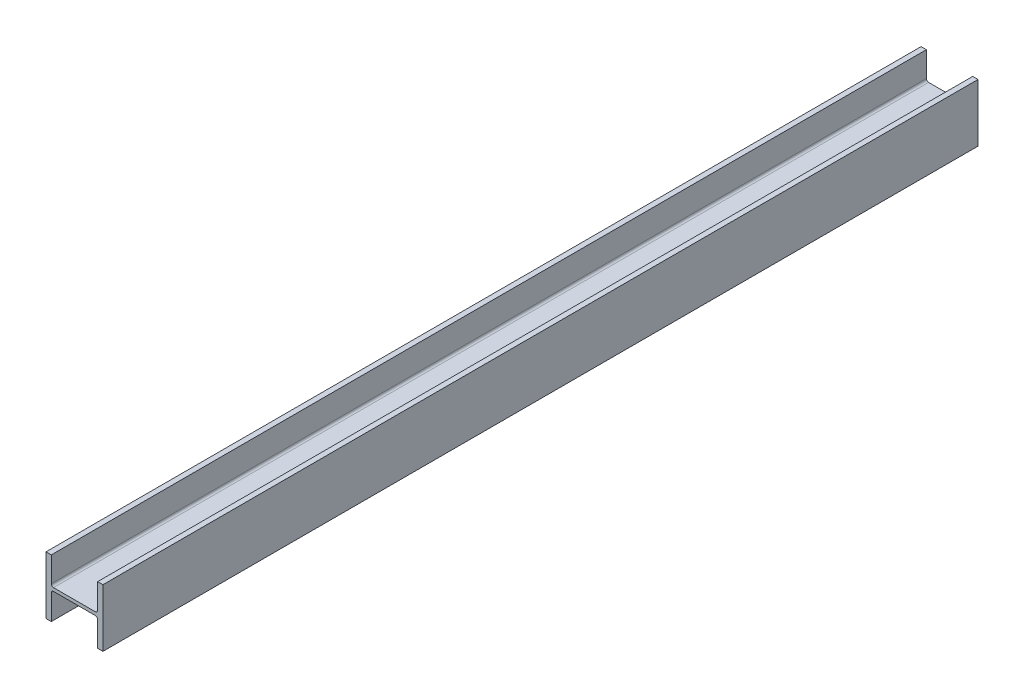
ISO-10303-21;
HEADER;
FILE_DESCRIPTION(('STEP AP214'),'2;1');
FILE_NAME('part.step','',(''),(''),'','','');
FILE_SCHEMA(('AUTOMOTIVE_DESIGN { 1 0 10303 214 1 1 1 1 }'));
ENDSEC;
DATA;
#1=APPLICATION_CONTEXT('core data for automotive mechanical design processes');
#2=APPLICATION_PROTOCOL_DEFINITION('international standard','automotive_design',2000,#1);
#3=PRODUCT_CONTEXT('',#1,'mechanical');
#4=PRODUCT('Part','Part','',(#3));
#5=PRODUCT_RELATED_PRODUCT_CATEGORY('part','',(#4));
#6=PRODUCT_DEFINITION_FORMATION('','',#4);
#7=PRODUCT_DEFINITION_CONTEXT('part definition',#1,'design');
#8=PRODUCT_DEFINITION('design','',#6,#7);
#9=PRODUCT_DEFINITION_SHAPE('','',#8);
#10=(LENGTH_UNIT() NAMED_UNIT(*) SI_UNIT(.MILLI.,.METRE.));
#11=(NAMED_UNIT(*) PLANE_ANGLE_UNIT() SI_UNIT($,.RADIAN.));
#12=(NAMED_UNIT(*) SI_UNIT($,.STERADIAN.) SOLID_ANGLE_UNIT());
#13=UNCERTAINTY_MEASURE_WITH_UNIT(LENGTH_MEASURE(1.E-05),#10,'distance_accuracy_value','');
#14=(GEOMETRIC_REPRESENTATION_CONTEXT(3) GLOBAL_UNCERTAINTY_ASSIGNED_CONTEXT((#13)) GLOBAL_UNIT_ASSIGNED_CONTEXT((#10,
#11,#12)) REPRESENTATION_CONTEXT('',''));
#15=CARTESIAN_POINT('',(0.,0.,0.));
#16=DIRECTION('',(0.,0.,1.));
#17=DIRECTION('',(1.,0.,0.));
#18=AXIS2_PLACEMENT_3D('',#15,#16,#17);
#19=CARTESIAN_POINT('',(196.596,199.517,3022.6));
#20=DIRECTION('',(-1.,0.,0.));
#21=DIRECTION('',(0.,0.,1.));
#22=AXIS2_PLACEMENT_3D('',#19,#20,#21);
#23=PLANE('',#22);
#24=DIRECTION('',(0.,1.,0.));
#25=VECTOR('',#24,1.);
#26=CARTESIAN_POINT('',(196.596,199.517,-3022.6));
#27=LINE('',#26,#25);
#28=CARTESIAN_POINT('',(196.596,-199.517,-3022.6));
#29=VERTEX_POINT('',#28);
#30=CARTESIAN_POINT('',(196.596,199.517,-3022.6));
#31=VERTEX_POINT('',#30);
#32=EDGE_CURVE('E194',#29,#31,#27,.T.);
#33=ORIENTED_EDGE('',*,*,#32,.T.);
#34=DIRECTION('',(0.,0.,-1.));
#35=VECTOR('',#34,1.);
#36=CARTESIAN_POINT('',(196.596,199.517,3022.6));
#37=LINE('',#36,#35);
#38=CARTESIAN_POINT('',(196.596,199.517,3022.6));
#39=VERTEX_POINT('',#38);
#40=EDGE_CURVE('E11',#39,#31,#37,.T.);
#41=ORIENTED_EDGE('',*,*,#40,.F.);
#42=DIRECTION('',(0.,1.,0.));
#43=VECTOR('',#42,1.);
#44=CARTESIAN_POINT('',(196.596,199.517,3022.6));
#45=LINE('',#44,#43);
#46=CARTESIAN_POINT('',(196.596,-199.517,3022.6));
#47=VERTEX_POINT('',#46);
#48=EDGE_CURVE('E238',#47,#39,#45,.T.);
#49=ORIENTED_EDGE('',*,*,#48,.F.);
#50=DIRECTION('',(0.,0.,-1.));
#51=VECTOR('',#50,1.);
#52=CARTESIAN_POINT('',(196.596,-199.517,3022.6));
#53=LINE('',#52,#51);
#54=EDGE_CURVE('E187',#47,#29,#53,.T.);
#55=ORIENTED_EDGE('',*,*,#54,.T.);
#56=EDGE_LOOP('',(#33,#41,#49,#55));
#57=FACE_BOUND('',#56,.T.);
#58=ADVANCED_FACE('F44',(#57),#23,.F.);
#59=CARTESIAN_POINT('',(160.02,199.517,3022.6));
#60=DIRECTION('',(0.,-1.,0.));
#61=DIRECTION('',(0.,0.,-1.));
#62=AXIS2_PLACEMENT_3D('',#59,#60,#61);
#63=PLANE('',#62);
#64=DIRECTION('',(-1.,0.,0.));
#65=VECTOR('',#64,1.);
#66=CARTESIAN_POINT('',(160.02,199.517,-3022.6));
#67=LINE('',#66,#65);
#68=CARTESIAN_POINT('',(160.02,199.517,-3022.6));
#69=VERTEX_POINT('',#68);
#70=EDGE_CURVE('E196',#31,#69,#67,.T.);
#71=ORIENTED_EDGE('',*,*,#70,.T.);
#72=DIRECTION('',(0.,0.,-1.));
#73=VECTOR('',#72,1.);
#74=CARTESIAN_POINT('',(160.02,199.517,3022.6));
#75=LINE('',#74,#73);
#76=CARTESIAN_POINT('',(160.02,199.517,3022.6));
#77=VERTEX_POINT('',#76);
#78=EDGE_CURVE('E53',#77,#69,#75,.T.);
#79=ORIENTED_EDGE('',*,*,#78,.F.);
#80=DIRECTION('',(-1.,0.,0.));
#81=VECTOR('',#80,1.);
#82=CARTESIAN_POINT('',(160.02,199.517,3022.6));
#83=LINE('',#82,#81);
#84=EDGE_CURVE('E129',#39,#77,#83,.T.);
#85=ORIENTED_EDGE('',*,*,#84,.F.);
#86=ORIENTED_EDGE('',*,*,#40,.T.);
#87=EDGE_LOOP('',(#71,#79,#85,#86));
#88=FACE_BOUND('',#87,.T.);
#89=ADVANCED_FACE('F362',(#88),#63,.F.);
#90=CARTESIAN_POINT('',(160.02,26.5430000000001,3022.6));
#91=DIRECTION('',(1.,0.,0.));
#92=DIRECTION('',(0.,0.,-1.));
#93=AXIS2_PLACEMENT_3D('',#90,#91,#92);
#94=PLANE('',#93);
#95=DIRECTION('',(0.,-1.,0.));
#96=VECTOR('',#95,1.);
#97=CARTESIAN_POINT('',(160.02,26.5430000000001,-3022.6));
#98=LINE('',#97,#96);
#99=CARTESIAN_POINT('',(160.02,26.5430000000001,-3022.6));
#100=VERTEX_POINT('',#99);
#101=EDGE_CURVE('E203',#69,#100,#98,.T.);
#102=ORIENTED_EDGE('',*,*,#101,.T.);
#103=DIRECTION('',(0.,0.,-1.));
#104=VECTOR('',#103,1.);
#105=CARTESIAN_POINT('',(160.02,26.5430000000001,3022.6));
#106=LINE('',#105,#104);
#107=CARTESIAN_POINT('',(160.02,26.5430000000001,3022.6));
#108=VERTEX_POINT('',#107);
#109=EDGE_CURVE('E281',#108,#100,#106,.T.);
#110=ORIENTED_EDGE('',*,*,#109,.F.);
#111=DIRECTION('',(0.,-1.,0.));
#112=VECTOR('',#111,1.);
#113=CARTESIAN_POINT('',(160.02,26.5430000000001,3022.6));
#114=LINE('',#113,#112);
#115=EDGE_CURVE('E291',#77,#108,#114,.T.);
#116=ORIENTED_EDGE('',*,*,#115,.F.);
#117=ORIENTED_EDGE('',*,*,#78,.T.);
#118=EDGE_LOOP('',(#102,#110,#116,#117));
#119=FACE_BOUND('',#118,.T.);
#120=ADVANCED_FACE('F292',(#119),#94,.F.);
#121=CARTESIAN_POINT('',(144.78,26.5430000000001,3022.6));
#122=DIRECTION('',(0.,0.,-1.));
#123=DIRECTION('',(-1.,0.,0.));
#124=AXIS2_PLACEMENT_3D('',#121,#122,#123);
#125=CYLINDRICAL_SURFACE('',#124,15.24);
#126=CARTESIAN_POINT('',(144.78,26.5430000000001,-3022.6));
#127=DIRECTION('',(0.,0.,-1.));
#128=DIRECTION('',(1.,0.,0.));
#129=AXIS2_PLACEMENT_3D('',#126,#127,#128);
#130=CIRCLE('',#129,15.24);
#131=CARTESIAN_POINT('',(144.78,11.3030000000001,-3022.6));
#132=VERTEX_POINT('',#131);
#133=EDGE_CURVE('E204',#100,#132,#130,.T.);
#134=ORIENTED_EDGE('',*,*,#133,.T.);
#135=DIRECTION('',(0.,0.,-1.));
#136=VECTOR('',#135,1.);
#137=CARTESIAN_POINT('',(144.78,11.3030000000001,3022.6));
#138=LINE('',#137,#136);
#139=CARTESIAN_POINT('',(144.78,11.3030000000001,3022.6));
#140=VERTEX_POINT('',#139);
#141=EDGE_CURVE('E276',#140,#132,#138,.T.);
#142=ORIENTED_EDGE('',*,*,#141,.F.);
#143=CARTESIAN_POINT('',(144.78,26.5430000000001,3022.6));
#144=DIRECTION('',(0.,0.,-1.));
#145=DIRECTION('',(1.,0.,0.));
#146=AXIS2_PLACEMENT_3D('',#143,#144,#145);
#147=CIRCLE('',#146,15.24);
#148=EDGE_CURVE('E315',#108,#140,#147,.T.);
#149=ORIENTED_EDGE('',*,*,#148,.F.);
#150=ORIENTED_EDGE('',*,*,#109,.T.);
#151=EDGE_LOOP('',(#134,#142,#149,#150));
#152=FACE_BOUND('',#151,.T.);
#153=ADVANCED_FACE('F305',(#152),#125,.F.);
#154=CARTESIAN_POINT('',(-144.78,11.3030000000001,3022.6));
#155=DIRECTION('',(0.,-1.,0.));
#156=DIRECTION('',(1.,0.,0.));
#157=AXIS2_PLACEMENT_3D('',#154,#155,#156);
#158=PLANE('',#157);
#159=DIRECTION('',(-1.,0.,0.));
#160=VECTOR('',#159,1.);
#161=CARTESIAN_POINT('',(-144.78,11.3030000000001,-3022.6));
#162=LINE('',#161,#160);
#163=CARTESIAN_POINT('',(-144.78,11.3030000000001,-3022.6));
#164=VERTEX_POINT('',#163);
#165=EDGE_CURVE('E210',#132,#164,#162,.T.);
#166=ORIENTED_EDGE('',*,*,#165,.T.);
#167=DIRECTION('',(0.,0.,-1.));
#168=VECTOR('',#167,1.);
#169=CARTESIAN_POINT('',(-144.78,11.3030000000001,3022.6));
#170=LINE('',#169,#168);
#171=CARTESIAN_POINT('',(-144.78,11.3030000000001,3022.6));
#172=VERTEX_POINT('',#171);
#173=EDGE_CURVE('E274',#172,#164,#170,.T.);
#174=ORIENTED_EDGE('',*,*,#173,.F.);
#175=DIRECTION('',(-1.,0.,0.));
#176=VECTOR('',#175,1.);
#177=CARTESIAN_POINT('',(-144.78,11.3030000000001,3022.6));
#178=LINE('',#177,#176);
#179=EDGE_CURVE('E306',#140,#172,#178,.T.);
#180=ORIENTED_EDGE('',*,*,#179,.F.);
#181=ORIENTED_EDGE('',*,*,#141,.T.);
#182=EDGE_LOOP('',(#166,#174,#180,#181));
#183=FACE_BOUND('',#182,.T.);
#184=ADVANCED_FACE('F308',(#183),#158,.F.);
#185=CARTESIAN_POINT('',(-144.78,26.5430000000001,3022.6));
#186=DIRECTION('',(0.,0.,-1.));
#187=DIRECTION('',(-1.,0.,0.));
#188=AXIS2_PLACEMENT_3D('',#185,#186,#187);
#189=CYLINDRICAL_SURFACE('',#188,15.24);
#190=CARTESIAN_POINT('',(-144.78,26.5430000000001,-3022.6));
#191=DIRECTION('',(0.,0.,-1.));
#192=DIRECTION('',(1.,0.,0.));
#193=AXIS2_PLACEMENT_3D('',#190,#191,#192);
#194=CIRCLE('',#193,15.24);
#195=CARTESIAN_POINT('',(-160.02,26.5430000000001,-3022.6));
#196=VERTEX_POINT('',#195);
#197=EDGE_CURVE('E209',#164,#196,#194,.T.);
#198=ORIENTED_EDGE('',*,*,#197,.T.);
#199=DIRECTION('',(0.,0.,-1.));
#200=VECTOR('',#199,1.);
#201=CARTESIAN_POINT('',(-160.02,26.5430000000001,3022.6));
#202=LINE('',#201,#200);
#203=CARTESIAN_POINT('',(-160.02,26.5430000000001,3022.6));
#204=VERTEX_POINT('',#203);
#205=EDGE_CURVE('E271',#204,#196,#202,.T.);
#206=ORIENTED_EDGE('',*,*,#205,.F.);
#207=CARTESIAN_POINT('',(-144.78,26.5430000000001,3022.6));
#208=DIRECTION('',(0.,0.,-1.));
#209=DIRECTION('',(1.,0.,0.));
#210=AXIS2_PLACEMENT_3D('',#207,#208,#209);
#211=CIRCLE('',#210,15.24);
#212=EDGE_CURVE('E313',#172,#204,#211,.T.);
#213=ORIENTED_EDGE('',*,*,#212,.F.);
#214=ORIENTED_EDGE('',*,*,#173,.T.);
#215=EDGE_LOOP('',(#198,#206,#213,#214));
#216=FACE_BOUND('',#215,.T.);
#217=ADVANCED_FACE('F374',(#216),#189,.F.);
#218=CARTESIAN_POINT('',(-160.02,199.517,3022.6));
#219=DIRECTION('',(-1.,0.,0.));
#220=DIRECTION('',(0.,0.,1.));
#221=AXIS2_PLACEMENT_3D('',#218,#219,#220);
#222=PLANE('',#221);
#223=DIRECTION('',(0.,1.,0.));
#224=VECTOR('',#223,1.);
#225=CARTESIAN_POINT('',(-160.02,199.517,-3022.6));
#226=LINE('',#225,#224);
#227=CARTESIAN_POINT('',(-160.02,199.517,-3022.6));
#228=VERTEX_POINT('',#227);
#229=EDGE_CURVE('E213',#196,#228,#226,.T.);
#230=ORIENTED_EDGE('',*,*,#229,.T.);
#231=DIRECTION('',(0.,0.,-1.));
#232=VECTOR('',#231,1.);
#233=CARTESIAN_POINT('',(-160.02,199.517,3022.6));
#234=LINE('',#233,#232);
#235=CARTESIAN_POINT('',(-160.02,199.517,3022.6));
#236=VERTEX_POINT('',#235);
#237=EDGE_CURVE('E270',#236,#228,#234,.T.);
#238=ORIENTED_EDGE('',*,*,#237,.F.);
#239=DIRECTION('',(0.,1.,0.));
#240=VECTOR('',#239,1.);
#241=CARTESIAN_POINT('',(-160.02,199.517,3022.6));
#242=LINE('',#241,#240);
#243=EDGE_CURVE('E316',#204,#236,#242,.T.);
#244=ORIENTED_EDGE('',*,*,#243,.F.);
#245=ORIENTED_EDGE('',*,*,#205,.T.);
#246=EDGE_LOOP('',(#230,#238,#244,#245));
#247=FACE_BOUND('',#246,.T.);
#248=ADVANCED_FACE('F378',(#247),#222,.F.);
#249=CARTESIAN_POINT('',(-196.596,199.517,3022.6));
#250=DIRECTION('',(0.,-1.,0.));
#251=DIRECTION('',(1.,0.,0.));
#252=AXIS2_PLACEMENT_3D('',#249,#250,#251);
#253=PLANE('',#252);
#254=DIRECTION('',(-1.,0.,0.));
#255=VECTOR('',#254,1.);
#256=CARTESIAN_POINT('',(-196.596,199.517,-3022.6));
#257=LINE('',#256,#255);
#258=CARTESIAN_POINT('',(-196.596,199.517,-3022.6));
#259=VERTEX_POINT('',#258);
#260=EDGE_CURVE('E216',#228,#259,#257,.T.);
#261=ORIENTED_EDGE('',*,*,#260,.T.);
#262=DIRECTION('',(0.,0.,-1.));
#263=VECTOR('',#262,1.);
#264=CARTESIAN_POINT('',(-196.596,199.517,3022.6));
#265=LINE('',#264,#263);
#266=CARTESIAN_POINT('',(-196.596,199.517,3022.6));
#267=VERTEX_POINT('',#266);
#268=EDGE_CURVE('E263',#267,#259,#265,.T.);
#269=ORIENTED_EDGE('',*,*,#268,.F.);
#270=DIRECTION('',(-1.,0.,0.));
#271=VECTOR('',#270,1.);
#272=CARTESIAN_POINT('',(-196.596,199.517,3022.6));
#273=LINE('',#272,#271);
#274=EDGE_CURVE('E323',#236,#267,#273,.T.);
#275=ORIENTED_EDGE('',*,*,#274,.F.);
#276=ORIENTED_EDGE('',*,*,#237,.T.);
#277=EDGE_LOOP('',(#261,#269,#275,#276));
#278=FACE_BOUND('',#277,.T.);
#279=ADVANCED_FACE('F385',(#278),#253,.F.);
#280=CARTESIAN_POINT('',(-196.596,-199.517,3022.6));
#281=DIRECTION('',(1.,0.,0.));
#282=DIRECTION('',(0.,0.,-1.));
#283=AXIS2_PLACEMENT_3D('',#280,#281,#282);
#284=PLANE('',#283);
#285=DIRECTION('',(0.,-1.,0.));
#286=VECTOR('',#285,1.);
#287=CARTESIAN_POINT('',(-196.596,-199.517,-3022.6));
#288=LINE('',#287,#286);
#289=CARTESIAN_POINT('',(-196.596,-199.517,-3022.6));
#290=VERTEX_POINT('',#289);
#291=EDGE_CURVE('E218',#259,#290,#288,.T.);
#292=ORIENTED_EDGE('',*,*,#291,.T.);
#293=DIRECTION('',(0.,0.,-1.));
#294=VECTOR('',#293,1.);
#295=CARTESIAN_POINT('',(-196.596,-199.517,3022.6));
#296=LINE('',#295,#294);
#297=CARTESIAN_POINT('',(-196.596,-199.517,3022.6));
#298=VERTEX_POINT('',#297);
#299=EDGE_CURVE('E259',#298,#290,#296,.T.);
#300=ORIENTED_EDGE('',*,*,#299,.F.);
#301=DIRECTION('',(0.,-1.,0.));
#302=VECTOR('',#301,1.);
#303=CARTESIAN_POINT('',(-196.596,-199.517,3022.6));
#304=LINE('',#303,#302);
#305=EDGE_CURVE('E326',#267,#298,#304,.T.);
#306=ORIENTED_EDGE('',*,*,#305,.F.);
#307=ORIENTED_EDGE('',*,*,#268,.T.);
#308=EDGE_LOOP('',(#292,#300,#306,#307));
#309=FACE_BOUND('',#308,.T.);
#310=ADVANCED_FACE('F387',(#309),#284,.F.);
#311=CARTESIAN_POINT('',(-160.02,-199.517,3022.6));
#312=DIRECTION('',(0.,1.,0.));
#313=DIRECTION('',(0.,0.,1.));
#314=AXIS2_PLACEMENT_3D('',#311,#312,#313);
#315=PLANE('',#314);
#316=DIRECTION('',(1.,0.,0.));
#317=VECTOR('',#316,1.);
#318=CARTESIAN_POINT('',(-160.02,-199.517,-3022.6));
#319=LINE('',#318,#317);
#320=CARTESIAN_POINT('',(-160.02,-199.517,-3022.6));
#321=VERTEX_POINT('',#320);
#322=EDGE_CURVE('E225',#290,#321,#319,.T.);
#323=ORIENTED_EDGE('',*,*,#322,.T.);
#324=DIRECTION('',(0.,0.,-1.));
#325=VECTOR('',#324,1.);
#326=CARTESIAN_POINT('',(-160.02,-199.517,3022.6));
#327=LINE('',#326,#325);
#328=CARTESIAN_POINT('',(-160.02,-199.517,3022.6));
#329=VERTEX_POINT('',#328);
#330=EDGE_CURVE('E254',#329,#321,#327,.T.);
#331=ORIENTED_EDGE('',*,*,#330,.F.);
#332=DIRECTION('',(1.,0.,0.));
#333=VECTOR('',#332,1.);
#334=CARTESIAN_POINT('',(-160.02,-199.517,3022.6));
#335=LINE('',#334,#333);
#336=EDGE_CURVE('E328',#298,#329,#335,.T.);
#337=ORIENTED_EDGE('',*,*,#336,.F.);
#338=ORIENTED_EDGE('',*,*,#299,.T.);
#339=EDGE_LOOP('',(#323,#331,#337,#338));
#340=FACE_BOUND('',#339,.T.);
#341=ADVANCED_FACE('F388',(#340),#315,.F.);
#342=CARTESIAN_POINT('',(-160.02,-26.5429999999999,3022.6));
#343=DIRECTION('',(-1.,0.,0.));
#344=DIRECTION('',(0.,0.,1.));
#345=AXIS2_PLACEMENT_3D('',#342,#343,#344);
#346=PLANE('',#345);
#347=DIRECTION('',(0.,1.,0.));
#348=VECTOR('',#347,1.);
#349=CARTESIAN_POINT('',(-160.02,-26.5429999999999,-3022.6));
#350=LINE('',#349,#348);
#351=CARTESIAN_POINT('',(-160.02,-26.5429999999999,-3022.6));
#352=VERTEX_POINT('',#351);
#353=EDGE_CURVE('E223',#321,#352,#350,.T.);
#354=ORIENTED_EDGE('',*,*,#353,.T.);
#355=DIRECTION('',(0.,0.,-1.));
#356=VECTOR('',#355,1.);
#357=CARTESIAN_POINT('',(-160.02,-26.5429999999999,3022.6));
#358=LINE('',#357,#356);
#359=CARTESIAN_POINT('',(-160.02,-26.5429999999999,3022.6));
#360=VERTEX_POINT('',#359);
#361=EDGE_CURVE('E253',#360,#352,#358,.T.);
#362=ORIENTED_EDGE('',*,*,#361,.F.);
#363=DIRECTION('',(0.,1.,0.));
#364=VECTOR('',#363,1.);
#365=CARTESIAN_POINT('',(-160.02,-26.5429999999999,3022.6));
#366=LINE('',#365,#364);
#367=EDGE_CURVE('E335',#329,#360,#366,.T.);
#368=ORIENTED_EDGE('',*,*,#367,.F.);
#369=ORIENTED_EDGE('',*,*,#330,.T.);
#370=EDGE_LOOP('',(#354,#362,#368,#369));
#371=FACE_BOUND('',#370,.T.);
#372=ADVANCED_FACE('F394',(#371),#346,.F.);
#373=CARTESIAN_POINT('',(-144.78,-26.5429999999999,3022.6));
#374=DIRECTION('',(0.,0.,-1.));
#375=DIRECTION('',(-1.,0.,0.));
#376=AXIS2_PLACEMENT_3D('',#373,#374,#375);
#377=CYLINDRICAL_SURFACE('',#376,15.24);
#378=CARTESIAN_POINT('',(-144.78,-26.5429999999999,-3022.6));
#379=DIRECTION('',(0.,0.,-1.));
#380=DIRECTION('',(1.,0.,0.));
#381=AXIS2_PLACEMENT_3D('',#378,#379,#380);
#382=CIRCLE('',#381,15.24);
#383=CARTESIAN_POINT('',(-144.78,-11.3029999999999,-3022.6));
#384=VERTEX_POINT('',#383);
#385=EDGE_CURVE('E226',#352,#384,#382,.T.);
#386=ORIENTED_EDGE('',*,*,#385,.T.);
#387=DIRECTION('',(0.,0.,-1.));
#388=VECTOR('',#387,1.);
#389=CARTESIAN_POINT('',(-144.78,-11.3029999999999,3022.6));
#390=LINE('',#389,#388);
#391=CARTESIAN_POINT('',(-144.78,-11.3029999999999,3022.6));
#392=VERTEX_POINT('',#391);
#393=EDGE_CURVE('E250',#392,#384,#390,.T.);
#394=ORIENTED_EDGE('',*,*,#393,.F.);
#395=CARTESIAN_POINT('',(-144.78,-26.5429999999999,3022.6));
#396=DIRECTION('',(0.,0.,-1.));
#397=DIRECTION('',(1.,0.,0.));
#398=AXIS2_PLACEMENT_3D('',#395,#396,#397);
#399=CIRCLE('',#398,15.24);
#400=EDGE_CURVE('E333',#360,#392,#399,.T.);
#401=ORIENTED_EDGE('',*,*,#400,.F.);
#402=ORIENTED_EDGE('',*,*,#361,.T.);
#403=EDGE_LOOP('',(#386,#394,#401,#402));
#404=FACE_BOUND('',#403,.T.);
#405=ADVANCED_FACE('F343',(#404),#377,.F.);
#406=CARTESIAN_POINT('',(144.78,-11.3029999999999,3022.6));
#407=DIRECTION('',(0.,1.,0.));
#408=DIRECTION('',(0.,0.,1.));
#409=AXIS2_PLACEMENT_3D('',#406,#407,#408);
#410=PLANE('',#409);
#411=DIRECTION('',(1.,0.,0.));
#412=VECTOR('',#411,1.);
#413=CARTESIAN_POINT('',(144.78,-11.3029999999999,-3022.6));
#414=LINE('',#413,#412);
#415=CARTESIAN_POINT('',(144.78,-11.3029999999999,-3022.6));
#416=VERTEX_POINT('',#415);
#417=EDGE_CURVE('E232',#384,#416,#414,.T.);
#418=ORIENTED_EDGE('',*,*,#417,.T.);
#419=DIRECTION('',(0.,0.,-1.));
#420=VECTOR('',#419,1.);
#421=CARTESIAN_POINT('',(144.78,-11.3029999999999,3022.6));
#422=LINE('',#421,#420);
#423=CARTESIAN_POINT('',(144.78,-11.3029999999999,3022.6));
#424=VERTEX_POINT('',#423);
#425=EDGE_CURVE('E181',#424,#416,#422,.T.);
#426=ORIENTED_EDGE('',*,*,#425,.F.);
#427=DIRECTION('',(1.,0.,0.));
#428=VECTOR('',#427,1.);
#429=CARTESIAN_POINT('',(144.78,-11.3029999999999,3022.6));
#430=LINE('',#429,#428);
#431=EDGE_CURVE('E175',#392,#424,#430,.T.);
#432=ORIENTED_EDGE('',*,*,#431,.F.);
#433=ORIENTED_EDGE('',*,*,#393,.T.);
#434=EDGE_LOOP('',(#418,#426,#432,#433));
#435=FACE_BOUND('',#434,.T.);
#436=ADVANCED_FACE('F350',(#435),#410,.F.);
#437=CARTESIAN_POINT('',(144.78,-26.5429999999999,3022.6));
#438=DIRECTION('',(0.,0.,-1.));
#439=DIRECTION('',(-1.,0.,0.));
#440=AXIS2_PLACEMENT_3D('',#437,#438,#439);
#441=CYLINDRICAL_SURFACE('',#440,15.24);
#442=CARTESIAN_POINT('',(144.78,-26.5429999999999,-3022.6));
#443=DIRECTION('',(0.,0.,-1.));
#444=DIRECTION('',(1.,0.,0.));
#445=AXIS2_PLACEMENT_3D('',#442,#443,#444);
#446=CIRCLE('',#445,15.24);
#447=CARTESIAN_POINT('',(160.02,-26.5429999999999,-3022.6));
#448=VERTEX_POINT('',#447);
#449=EDGE_CURVE('E182',#416,#448,#446,.T.);
#450=ORIENTED_EDGE('',*,*,#449,.T.);
#451=DIRECTION('',(0.,0.,-1.));
#452=VECTOR('',#451,1.);
#453=CARTESIAN_POINT('',(160.02,-26.5429999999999,3022.6));
#454=LINE('',#453,#452);
#455=CARTESIAN_POINT('',(160.02,-26.5429999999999,3022.6));
#456=VERTEX_POINT('',#455);
#457=EDGE_CURVE('E178',#456,#448,#454,.T.);
#458=ORIENTED_EDGE('',*,*,#457,.F.);
#459=CARTESIAN_POINT('',(144.78,-26.5429999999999,3022.6));
#460=DIRECTION('',(0.,0.,-1.));
#461=DIRECTION('',(1.,0.,0.));
#462=AXIS2_PLACEMENT_3D('',#459,#460,#461);
#463=CIRCLE('',#462,15.24);
#464=EDGE_CURVE('E167',#424,#456,#463,.T.);
#465=ORIENTED_EDGE('',*,*,#464,.F.);
#466=ORIENTED_EDGE('',*,*,#425,.T.);
#467=EDGE_LOOP('',(#450,#458,#465,#466));
#468=FACE_BOUND('',#467,.T.);
#469=ADVANCED_FACE('F179',(#468),#441,.F.);
#470=CARTESIAN_POINT('',(160.02,-199.517,3022.6));
#471=DIRECTION('',(1.,0.,0.));
#472=DIRECTION('',(0.,0.,-1.));
#473=AXIS2_PLACEMENT_3D('',#470,#471,#472);
#474=PLANE('',#473);
#475=DIRECTION('',(0.,-1.,0.));
#476=VECTOR('',#475,1.);
#477=CARTESIAN_POINT('',(160.02,-199.517,-3022.6));
#478=LINE('',#477,#476);
#479=CARTESIAN_POINT('',(160.02,-199.517,-3022.6));
#480=VERTEX_POINT('',#479);
#481=EDGE_CURVE('E113',#448,#480,#478,.T.);
#482=ORIENTED_EDGE('',*,*,#481,.T.);
#483=DIRECTION('',(0.,0.,-1.));
#484=VECTOR('',#483,1.);
#485=CARTESIAN_POINT('',(160.02,-199.517,3022.6));
#486=LINE('',#485,#484);
#487=CARTESIAN_POINT('',(160.02,-199.517,3022.6));
#488=VERTEX_POINT('',#487);
#489=EDGE_CURVE('E184',#488,#480,#486,.T.);
#490=ORIENTED_EDGE('',*,*,#489,.F.);
#491=DIRECTION('',(0.,-1.,0.));
#492=VECTOR('',#491,1.);
#493=CARTESIAN_POINT('',(160.02,-199.517,3022.6));
#494=LINE('',#493,#492);
#495=EDGE_CURVE('E168',#456,#488,#494,.T.);
#496=ORIENTED_EDGE('',*,*,#495,.F.);
#497=ORIENTED_EDGE('',*,*,#457,.T.);
#498=EDGE_LOOP('',(#482,#490,#496,#497));
#499=FACE_BOUND('',#498,.T.);
#500=ADVANCED_FACE('F188',(#499),#474,.F.);
#501=CARTESIAN_POINT('',(196.596,-199.517,3022.6));
#502=DIRECTION('',(0.,1.,0.));
#503=DIRECTION('',(0.,0.,1.));
#504=AXIS2_PLACEMENT_3D('',#501,#502,#503);
#505=PLANE('',#504);
#506=DIRECTION('',(1.,0.,0.));
#507=VECTOR('',#506,1.);
#508=CARTESIAN_POINT('',(196.596,-199.517,-3022.6));
#509=LINE('',#508,#507);
#510=EDGE_CURVE('E122',#480,#29,#509,.T.);
#511=ORIENTED_EDGE('',*,*,#510,.T.);
#512=ORIENTED_EDGE('',*,*,#54,.F.);
#513=DIRECTION('',(1.,0.,0.));
#514=VECTOR('',#513,1.);
#515=CARTESIAN_POINT('',(196.596,-199.517,3022.6));
#516=LINE('',#515,#514);
#517=EDGE_CURVE('E65',#488,#47,#516,.T.);
#518=ORIENTED_EDGE('',*,*,#517,.F.);
#519=ORIENTED_EDGE('',*,*,#489,.T.);
#520=EDGE_LOOP('',(#511,#512,#518,#519));
#521=FACE_BOUND('',#520,.T.);
#522=ADVANCED_FACE('F353',(#521),#505,.F.);
#523=CARTESIAN_POINT('',(144.78,-26.5429999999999,3022.6));
#524=DIRECTION('',(0.,0.,1.));
#525=DIRECTION('',(1.,0.,0.));
#526=AXIS2_PLACEMENT_3D('',#523,#524,#525);
#527=PLANE('',#526);
#528=ORIENTED_EDGE('',*,*,#48,.T.);
#529=ORIENTED_EDGE('',*,*,#84,.T.);
#530=ORIENTED_EDGE('',*,*,#115,.T.);
#531=ORIENTED_EDGE('',*,*,#148,.T.);
#532=ORIENTED_EDGE('',*,*,#179,.T.);
#533=ORIENTED_EDGE('',*,*,#212,.T.);
#534=ORIENTED_EDGE('',*,*,#243,.T.);
#535=ORIENTED_EDGE('',*,*,#274,.T.);
#536=ORIENTED_EDGE('',*,*,#305,.T.);
#537=ORIENTED_EDGE('',*,*,#336,.T.);
#538=ORIENTED_EDGE('',*,*,#367,.T.);
#539=ORIENTED_EDGE('',*,*,#400,.T.);
#540=ORIENTED_EDGE('',*,*,#431,.T.);
#541=ORIENTED_EDGE('',*,*,#464,.T.);
#542=ORIENTED_EDGE('',*,*,#495,.T.);
#543=ORIENTED_EDGE('',*,*,#517,.T.);
#544=EDGE_LOOP('',(#528,#529,#530,#531,#532,#533,#534,#535,#536,#537,#538,#539,#540,#541,#542,#543));
#545=FACE_BOUND('',#544,.T.);
#546=ADVANCED_FACE('F169',(#545),#527,.T.);
#547=CARTESIAN_POINT('',(144.78,-26.5429999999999,-3022.6));
#548=DIRECTION('',(0.,0.,1.));
#549=DIRECTION('',(1.,0.,0.));
#550=AXIS2_PLACEMENT_3D('',#547,#548,#549);
#551=PLANE('',#550);
#552=ORIENTED_EDGE('',*,*,#32,.F.);
#553=ORIENTED_EDGE('',*,*,#510,.F.);
#554=ORIENTED_EDGE('',*,*,#481,.F.);
#555=ORIENTED_EDGE('',*,*,#449,.F.);
#556=ORIENTED_EDGE('',*,*,#417,.F.);
#557=ORIENTED_EDGE('',*,*,#385,.F.);
#558=ORIENTED_EDGE('',*,*,#353,.F.);
#559=ORIENTED_EDGE('',*,*,#322,.F.);
#560=ORIENTED_EDGE('',*,*,#291,.F.);
#561=ORIENTED_EDGE('',*,*,#260,.F.);
#562=ORIENTED_EDGE('',*,*,#229,.F.);
#563=ORIENTED_EDGE('',*,*,#197,.F.);
#564=ORIENTED_EDGE('',*,*,#165,.F.);
#565=ORIENTED_EDGE('',*,*,#133,.F.);
#566=ORIENTED_EDGE('',*,*,#101,.F.);
#567=ORIENTED_EDGE('',*,*,#70,.F.);
#568=EDGE_LOOP('',(#552,#553,#554,#555,#556,#557,#558,#559,#560,#561,#562,#563,#564,#565,#566,#567));
#569=FACE_BOUND('',#568,.T.);
#570=ADVANCED_FACE('F300',(#569),#551,.F.);
#571=CLOSED_SHELL('',(#58,#89,#120,#153,#184,#217,#248,#279,#310,#341,#372,#405,#436,#469,#500,
#522,#546,#570));
#572=MANIFOLD_SOLID_BREP('B2',#571);
#573=ADVANCED_BREP_SHAPE_REPRESENTATION('',(#18,#572),#14);
#574=SHAPE_DEFINITION_REPRESENTATION(#9,#573);
ENDSEC;
END-ISO-10303-21;
